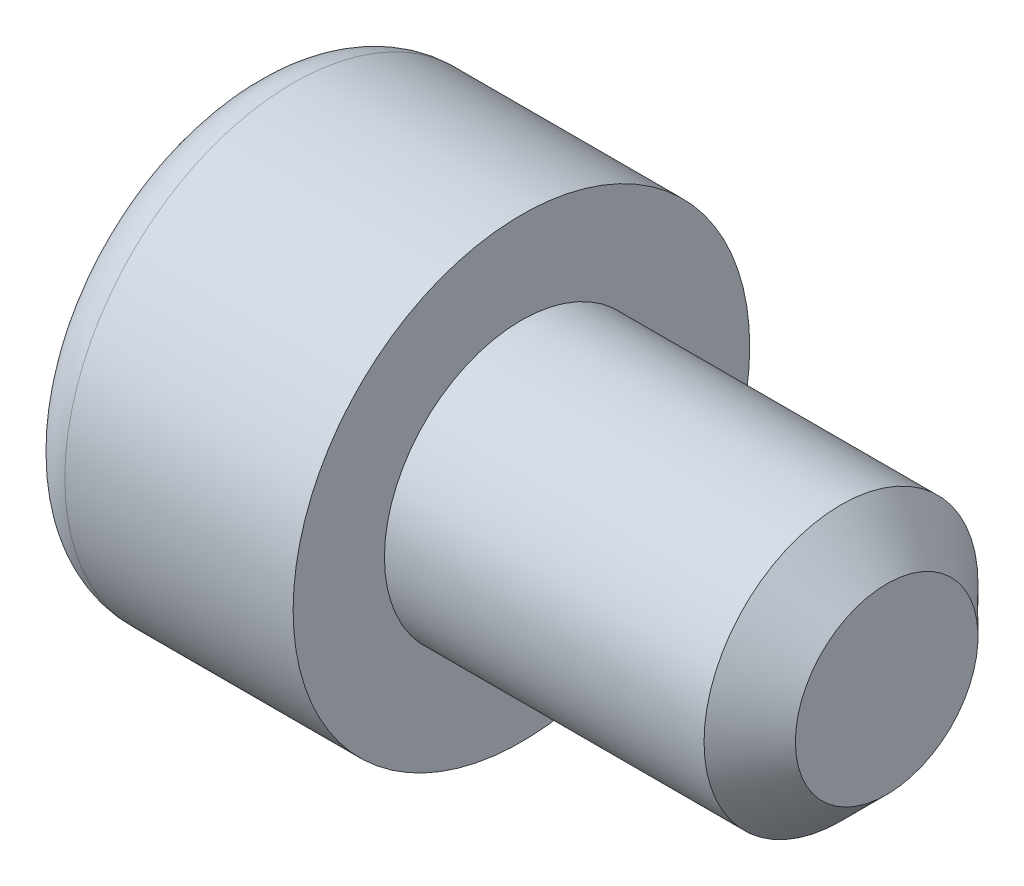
from build123d import *

# Parameters (mm, degrees)
ENL_V_MAT_EXTRU_1_DEPTH = 3


with BuildPart() as part:
    # Esquisse1 → Base-R_volution (revolve)
    with BuildSketch(Plane.XY, mode=Mode.PRIVATE) as base_r_volution_sk:
        with BuildLine():
            Line((-6, 0), (-6, 4))
            ThreePointArc((-6, 4), (-5.707106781, 4.707106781), (-5, 5))
            Line((-5, 5), (0, 5))
            Line((0, 5), (0, 3))
            Line((0, 3), (7, 3))
            Line((7, 3), (8, 2))
            Line((8, 2), (8, 0))
            Line((8, 0), (-6, 0))
        make_face()
    revolve(base_r_volution_sk.sketch.rotate(Axis((-28.576196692, 0, 0), (1, 0, 0)), 90), axis=Axis((-28.576196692, 0, 0), (1, 0, 0)))

    # Esquisse2 → Enl_v. mat.-Extru.1 (cut)
    with BuildSketch(Plane(origin=(-6, 5.465458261, -1.391437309), x_dir=(0, 0, 1), z_dir=(-1, 0, 0))):
        Polygon((-0.504565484, -7.659075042), (-1.508007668, -5.465458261), (-0.020287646, -2.932907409), (3.287440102, -3.271841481), (4.290882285, -5.465458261), (2.803162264, -7.998009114), align=None)
    extrude(amount=-ENL_V_MAT_EXTRU_1_DEPTH, mode=Mode.SUBTRACT)


solid = part.part
